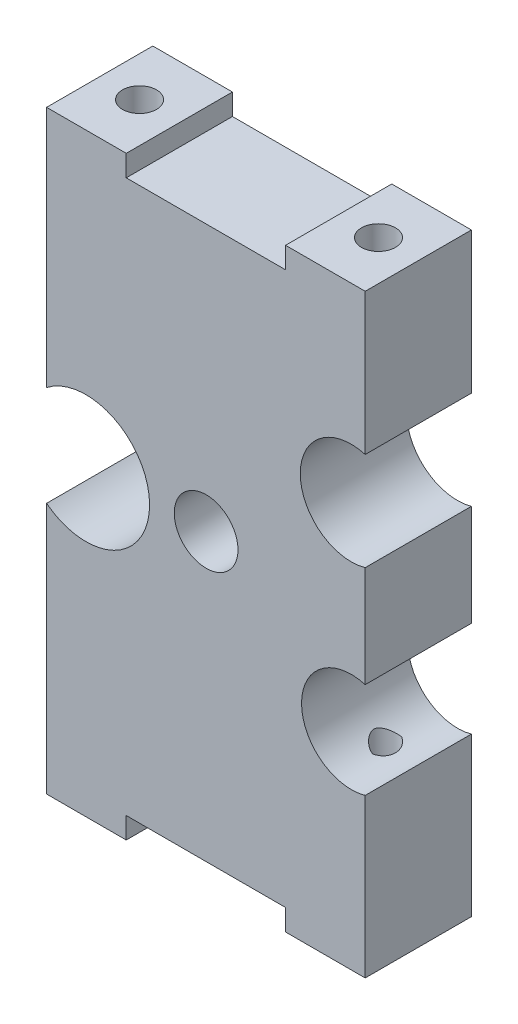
ISO-10303-21;
HEADER;
FILE_DESCRIPTION(('STEP AP214'),'2;1');
FILE_NAME('part.step','',(''),(''),'','','');
FILE_SCHEMA(('AUTOMOTIVE_DESIGN { 1 0 10303 214 1 1 1 1 }'));
ENDSEC;
DATA;
#1=APPLICATION_CONTEXT('core data for automotive mechanical design processes');
#2=APPLICATION_PROTOCOL_DEFINITION('international standard','automotive_design',2000,#1);
#3=PRODUCT_CONTEXT('',#1,'mechanical');
#4=PRODUCT('Part','Part','',(#3));
#5=PRODUCT_RELATED_PRODUCT_CATEGORY('part','',(#4));
#6=PRODUCT_DEFINITION_FORMATION('','',#4);
#7=PRODUCT_DEFINITION_CONTEXT('part definition',#1,'design');
#8=PRODUCT_DEFINITION('design','',#6,#7);
#9=PRODUCT_DEFINITION_SHAPE('','',#8);
#10=(LENGTH_UNIT() NAMED_UNIT(*) SI_UNIT(.MILLI.,.METRE.));
#11=(NAMED_UNIT(*) PLANE_ANGLE_UNIT() SI_UNIT($,.RADIAN.));
#12=(NAMED_UNIT(*) SI_UNIT($,.STERADIAN.) SOLID_ANGLE_UNIT());
#13=UNCERTAINTY_MEASURE_WITH_UNIT(LENGTH_MEASURE(1.E-05),#10,'distance_accuracy_value','');
#14=(GEOMETRIC_REPRESENTATION_CONTEXT(3) GLOBAL_UNCERTAINTY_ASSIGNED_CONTEXT((#13)) GLOBAL_UNIT_ASSIGNED_CONTEXT((#10,
#11,#12)) REPRESENTATION_CONTEXT('',''));
#15=CARTESIAN_POINT('',(0.,0.,0.));
#16=DIRECTION('',(0.,0.,1.));
#17=DIRECTION('',(1.,0.,0.));
#18=AXIS2_PLACEMENT_3D('',#15,#16,#17);
#19=CARTESIAN_POINT('',(-22.3355651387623,-0.533133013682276,20.));
#20=DIRECTION('',(0.,0.,-1.));
#21=DIRECTION('',(-1.,0.,0.));
#22=AXIS2_PLACEMENT_3D('',#19,#20,#21);
#23=PLANE('',#22);
#24=CARTESIAN_POINT('',(-22.3355651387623,-0.533133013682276,20.));
#25=DIRECTION('',(0.,0.,-1.));
#26=DIRECTION('',(-1.,0.,0.));
#27=AXIS2_PLACEMENT_3D('',#24,#25,#26);
#28=CIRCLE('',#27,11.993293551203);
#29=CARTESIAN_POINT('',(-29.7378152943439,8.90327429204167,20.));
#30=VERTEX_POINT('',#29);
#31=CARTESIAN_POINT('',(-29.7378152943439,-9.96954031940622,20.));
#32=VERTEX_POINT('',#31);
#33=EDGE_CURVE('E214',#30,#32,#28,.T.);
#34=ORIENTED_EDGE('',*,*,#33,.T.);
#35=DIRECTION('',(0.,-1.,0.));
#36=VECTOR('',#35,1.);
#37=CARTESIAN_POINT('',(-29.7378152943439,-57.389146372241,20.));
#38=LINE('',#37,#36);
#39=CARTESIAN_POINT('',(-29.7378152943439,-57.389146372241,20.));
#40=VERTEX_POINT('',#39);
#41=EDGE_CURVE('E217',#32,#40,#38,.T.);
#42=ORIENTED_EDGE('',*,*,#41,.T.);
#43=DIRECTION('',(1.,0.,0.));
#44=VECTOR('',#43,1.);
#45=CARTESIAN_POINT('',(-14.7378152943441,-57.389146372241,20.));
#46=LINE('',#45,#44);
#47=CARTESIAN_POINT('',(-14.7378152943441,-57.389146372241,20.));
#48=VERTEX_POINT('',#47);
#49=EDGE_CURVE('E220',#40,#48,#46,.T.);
#50=ORIENTED_EDGE('',*,*,#49,.T.);
#51=DIRECTION('',(0.,1.,0.));
#52=VECTOR('',#51,1.);
#53=CARTESIAN_POINT('',(-14.7378152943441,-53.389146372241,20.));
#54=LINE('',#53,#52);
#55=CARTESIAN_POINT('',(-14.7378152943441,-53.389146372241,20.));
#56=VERTEX_POINT('',#55);
#57=EDGE_CURVE('E222',#48,#56,#54,.T.);
#58=ORIENTED_EDGE('',*,*,#57,.T.);
#59=DIRECTION('',(1.,0.,0.));
#60=VECTOR('',#59,1.);
#61=CARTESIAN_POINT('',(15.2621847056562,-53.389146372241,20.));
#62=LINE('',#61,#60);
#63=CARTESIAN_POINT('',(15.2621847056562,-53.389146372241,20.));
#64=VERTEX_POINT('',#63);
#65=EDGE_CURVE('E224',#56,#64,#62,.T.);
#66=ORIENTED_EDGE('',*,*,#65,.T.);
#67=DIRECTION('',(0.,-1.,0.));
#68=VECTOR('',#67,1.);
#69=CARTESIAN_POINT('',(15.2621847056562,-57.3891463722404,20.));
#70=LINE('',#69,#68);
#71=CARTESIAN_POINT('',(15.2621847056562,-57.3891463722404,20.));
#72=VERTEX_POINT('',#71);
#73=EDGE_CURVE('E226',#64,#72,#70,.T.);
#74=ORIENTED_EDGE('',*,*,#73,.T.);
#75=DIRECTION('',(1.,0.,0.));
#76=VECTOR('',#75,1.);
#77=CARTESIAN_POINT('',(30.2621847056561,-57.3891463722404,20.));
#78=LINE('',#77,#76);
#79=CARTESIAN_POINT('',(30.2621847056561,-57.3891463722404,20.));
#80=VERTEX_POINT('',#79);
#81=EDGE_CURVE('E228',#72,#80,#78,.T.);
#82=ORIENTED_EDGE('',*,*,#81,.T.);
#83=DIRECTION('',(0.,1.,0.));
#84=VECTOR('',#83,1.);
#85=CARTESIAN_POINT('',(30.2621847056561,-27.607184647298,20.));
#86=LINE('',#85,#84);
#87=CARTESIAN_POINT('',(30.2621847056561,-27.607184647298,20.));
#88=VERTEX_POINT('',#87);
#89=EDGE_CURVE('E230',#80,#88,#86,.T.);
#90=ORIENTED_EDGE('',*,*,#89,.T.);
#91=CARTESIAN_POINT('',(27.6706531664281,-18.5753428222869,20.));
#92=DIRECTION('',(0.,0.,-1.));
#93=DIRECTION('',(-1.,0.,0.));
#94=AXIS2_PLACEMENT_3D('',#91,#92,#93);
#95=CIRCLE('',#94,9.39628663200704);
#96=CARTESIAN_POINT('',(30.2621847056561,-9.54350099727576,20.));
#97=VERTEX_POINT('',#96);
#98=EDGE_CURVE('E232',#88,#97,#95,.T.);
#99=ORIENTED_EDGE('',*,*,#98,.T.);
#100=DIRECTION('',(0.,1.,0.));
#101=VECTOR('',#100,1.);
#102=CARTESIAN_POINT('',(30.2621847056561,9.53555622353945,20.));
#103=LINE('',#102,#101);
#104=CARTESIAN_POINT('',(30.2621847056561,9.53555622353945,20.));
#105=VERTEX_POINT('',#104);
#106=EDGE_CURVE('E234',#97,#105,#103,.T.);
#107=ORIENTED_EDGE('',*,*,#106,.T.);
#108=CARTESIAN_POINT('',(27.6334143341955,18.7634673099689,20.));
#109=DIRECTION('',(0.,0.,-1.));
#110=DIRECTION('',(1.,0.,0.));
#111=AXIS2_PLACEMENT_3D('',#108,#109,#110);
#112=CIRCLE('',#111,9.59503917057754);
#113=CARTESIAN_POINT('',(30.2621847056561,27.9913783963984,20.));
#114=VERTEX_POINT('',#113);
#115=EDGE_CURVE('E236',#105,#114,#112,.T.);
#116=ORIENTED_EDGE('',*,*,#115,.T.);
#117=DIRECTION('',(0.,1.,0.));
#118=VECTOR('',#117,1.);
#119=CARTESIAN_POINT('',(30.2621847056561,54.6108536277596,20.));
#120=LINE('',#119,#118);
#121=CARTESIAN_POINT('',(30.2621847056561,54.6108536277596,20.));
#122=VERTEX_POINT('',#121);
#123=EDGE_CURVE('E238',#114,#122,#120,.T.);
#124=ORIENTED_EDGE('',*,*,#123,.T.);
#125=DIRECTION('',(-1.,0.,0.));
#126=VECTOR('',#125,1.);
#127=CARTESIAN_POINT('',(15.2621847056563,54.6108536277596,20.));
#128=LINE('',#127,#126);
#129=CARTESIAN_POINT('',(15.2621847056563,54.6108536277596,20.));
#130=VERTEX_POINT('',#129);
#131=EDGE_CURVE('E240',#122,#130,#128,.T.);
#132=ORIENTED_EDGE('',*,*,#131,.T.);
#133=DIRECTION('',(0.,-1.,0.));
#134=VECTOR('',#133,1.);
#135=CARTESIAN_POINT('',(15.2621847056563,50.610853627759,20.));
#136=LINE('',#135,#134);
#137=CARTESIAN_POINT('',(15.2621847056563,50.610853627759,20.));
#138=VERTEX_POINT('',#137);
#139=EDGE_CURVE('E242',#130,#138,#136,.T.);
#140=ORIENTED_EDGE('',*,*,#139,.T.);
#141=DIRECTION('',(-1.,0.,0.));
#142=VECTOR('',#141,1.);
#143=CARTESIAN_POINT('',(-14.7378152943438,50.610853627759,20.));
#144=LINE('',#143,#142);
#145=CARTESIAN_POINT('',(-14.7378152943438,50.610853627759,20.));
#146=VERTEX_POINT('',#145);
#147=EDGE_CURVE('E244',#138,#146,#144,.T.);
#148=ORIENTED_EDGE('',*,*,#147,.T.);
#149=DIRECTION('',(0.,1.,0.));
#150=VECTOR('',#149,1.);
#151=CARTESIAN_POINT('',(-14.7378152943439,54.610853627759,20.));
#152=LINE('',#151,#150);
#153=CARTESIAN_POINT('',(-14.7378152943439,54.610853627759,20.));
#154=VERTEX_POINT('',#153);
#155=EDGE_CURVE('E246',#146,#154,#152,.T.);
#156=ORIENTED_EDGE('',*,*,#155,.T.);
#157=DIRECTION('',(-1.,0.,0.));
#158=VECTOR('',#157,1.);
#159=CARTESIAN_POINT('',(-29.7378152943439,54.610853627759,20.));
#160=LINE('',#159,#158);
#161=CARTESIAN_POINT('',(-29.7378152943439,54.610853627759,20.));
#162=VERTEX_POINT('',#161);
#163=EDGE_CURVE('E248',#154,#162,#160,.T.);
#164=ORIENTED_EDGE('',*,*,#163,.T.);
#165=DIRECTION('',(0.,-1.,0.));
#166=VECTOR('',#165,1.);
#167=CARTESIAN_POINT('',(-29.7378152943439,8.90327429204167,20.));
#168=LINE('',#167,#166);
#169=EDGE_CURVE('E250',#162,#30,#168,.T.);
#170=ORIENTED_EDGE('',*,*,#169,.T.);
#171=EDGE_LOOP('',(#34,#42,#50,#58,#66,#74,#82,#90,#99,#107,#116,#124,#132,#140,#148,#156,#164,#170));
#172=FACE_BOUND('',#171,.T.);
#173=CARTESIAN_POINT('',(0.301417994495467,0.458443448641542,20.));
#174=DIRECTION('',(0.,0.,1.));
#175=DIRECTION('',(1.,0.,0.));
#176=AXIS2_PLACEMENT_3D('',#173,#174,#175);
#177=CIRCLE('',#176,6.);
#178=CARTESIAN_POINT('',(6.30141799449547,0.458443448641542,20.));
#179=VERTEX_POINT('',#178);
#180=EDGE_CURVE('E208',#179,#179,#177,.T.);
#181=ORIENTED_EDGE('',*,*,#180,.F.);
#182=EDGE_LOOP('',(#181));
#183=FACE_BOUND('',#182,.T.);
#184=ADVANCED_FACE('F32',(#172,#183),#23,.F.);
#185=CARTESIAN_POINT('',(-22.3355651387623,-0.533133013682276,0.));
#186=DIRECTION('',(0.,0.,-1.));
#187=DIRECTION('',(-1.,0.,0.));
#188=AXIS2_PLACEMENT_3D('',#185,#186,#187);
#189=PLANE('',#188);
#190=CARTESIAN_POINT('',(-22.3355651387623,-0.533133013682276,0.));
#191=DIRECTION('',(0.,0.,-1.));
#192=DIRECTION('',(-1.,0.,0.));
#193=AXIS2_PLACEMENT_3D('',#190,#191,#192);
#194=CIRCLE('',#193,11.993293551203);
#195=CARTESIAN_POINT('',(-29.7378152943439,8.90327429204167,0.));
#196=VERTEX_POINT('',#195);
#197=CARTESIAN_POINT('',(-29.7378152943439,-9.96954031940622,0.));
#198=VERTEX_POINT('',#197);
#199=EDGE_CURVE('E211',#196,#198,#194,.T.);
#200=ORIENTED_EDGE('',*,*,#199,.F.);
#201=DIRECTION('',(0.,-1.,0.));
#202=VECTOR('',#201,1.);
#203=CARTESIAN_POINT('',(-29.7378152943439,8.90327429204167,0.));
#204=LINE('',#203,#202);
#205=CARTESIAN_POINT('',(-29.7378152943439,54.610853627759,0.));
#206=VERTEX_POINT('',#205);
#207=EDGE_CURVE('E218',#206,#196,#204,.T.);
#208=ORIENTED_EDGE('',*,*,#207,.F.);
#209=DIRECTION('',(-1.,0.,0.));
#210=VECTOR('',#209,1.);
#211=CARTESIAN_POINT('',(-29.7378152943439,54.610853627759,0.));
#212=LINE('',#211,#210);
#213=CARTESIAN_POINT('',(-14.7378152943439,54.610853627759,0.));
#214=VERTEX_POINT('',#213);
#215=EDGE_CURVE('E285',#214,#206,#212,.T.);
#216=ORIENTED_EDGE('',*,*,#215,.F.);
#217=DIRECTION('',(0.,1.,0.));
#218=VECTOR('',#217,1.);
#219=CARTESIAN_POINT('',(-14.7378152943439,54.610853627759,0.));
#220=LINE('',#219,#218);
#221=CARTESIAN_POINT('',(-14.7378152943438,50.610853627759,0.));
#222=VERTEX_POINT('',#221);
#223=EDGE_CURVE('E283',#222,#214,#220,.T.);
#224=ORIENTED_EDGE('',*,*,#223,.F.);
#225=DIRECTION('',(-1.,0.,0.));
#226=VECTOR('',#225,1.);
#227=CARTESIAN_POINT('',(-14.7378152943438,50.610853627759,0.));
#228=LINE('',#227,#226);
#229=CARTESIAN_POINT('',(15.2621847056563,50.610853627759,0.));
#230=VERTEX_POINT('',#229);
#231=EDGE_CURVE('E281',#230,#222,#228,.T.);
#232=ORIENTED_EDGE('',*,*,#231,.F.);
#233=DIRECTION('',(0.,-1.,0.));
#234=VECTOR('',#233,1.);
#235=CARTESIAN_POINT('',(15.2621847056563,50.610853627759,0.));
#236=LINE('',#235,#234);
#237=CARTESIAN_POINT('',(15.2621847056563,54.6108536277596,0.));
#238=VERTEX_POINT('',#237);
#239=EDGE_CURVE('E279',#238,#230,#236,.T.);
#240=ORIENTED_EDGE('',*,*,#239,.F.);
#241=DIRECTION('',(-1.,0.,0.));
#242=VECTOR('',#241,1.);
#243=CARTESIAN_POINT('',(15.2621847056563,54.6108536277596,0.));
#244=LINE('',#243,#242);
#245=CARTESIAN_POINT('',(30.2621847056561,54.6108536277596,0.));
#246=VERTEX_POINT('',#245);
#247=EDGE_CURVE('E277',#246,#238,#244,.T.);
#248=ORIENTED_EDGE('',*,*,#247,.F.);
#249=DIRECTION('',(0.,1.,0.));
#250=VECTOR('',#249,1.);
#251=CARTESIAN_POINT('',(30.2621847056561,54.6108536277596,0.));
#252=LINE('',#251,#250);
#253=CARTESIAN_POINT('',(30.2621847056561,27.9913783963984,0.));
#254=VERTEX_POINT('',#253);
#255=EDGE_CURVE('E275',#254,#246,#252,.T.);
#256=ORIENTED_EDGE('',*,*,#255,.F.);
#257=CARTESIAN_POINT('',(27.6334143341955,18.7634673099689,0.));
#258=DIRECTION('',(0.,0.,-1.));
#259=DIRECTION('',(1.,0.,0.));
#260=AXIS2_PLACEMENT_3D('',#257,#258,#259);
#261=CIRCLE('',#260,9.59503917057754);
#262=CARTESIAN_POINT('',(30.2621847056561,9.53555622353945,0.));
#263=VERTEX_POINT('',#262);
#264=EDGE_CURVE('E273',#263,#254,#261,.T.);
#265=ORIENTED_EDGE('',*,*,#264,.F.);
#266=DIRECTION('',(0.,1.,0.));
#267=VECTOR('',#266,1.);
#268=CARTESIAN_POINT('',(30.2621847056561,9.53555622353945,0.));
#269=LINE('',#268,#267);
#270=CARTESIAN_POINT('',(30.2621847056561,-9.54350099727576,0.));
#271=VERTEX_POINT('',#270);
#272=EDGE_CURVE('E271',#271,#263,#269,.T.);
#273=ORIENTED_EDGE('',*,*,#272,.F.);
#274=CARTESIAN_POINT('',(27.6706531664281,-18.5753428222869,0.));
#275=DIRECTION('',(0.,0.,-1.));
#276=DIRECTION('',(-1.,0.,0.));
#277=AXIS2_PLACEMENT_3D('',#274,#275,#276);
#278=CIRCLE('',#277,9.39628663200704);
#279=CARTESIAN_POINT('',(30.2621847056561,-27.607184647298,0.));
#280=VERTEX_POINT('',#279);
#281=EDGE_CURVE('E269',#280,#271,#278,.T.);
#282=ORIENTED_EDGE('',*,*,#281,.F.);
#283=DIRECTION('',(0.,1.,0.));
#284=VECTOR('',#283,1.);
#285=CARTESIAN_POINT('',(30.2621847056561,-27.607184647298,0.));
#286=LINE('',#285,#284);
#287=CARTESIAN_POINT('',(30.2621847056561,-57.3891463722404,0.));
#288=VERTEX_POINT('',#287);
#289=EDGE_CURVE('E267',#288,#280,#286,.T.);
#290=ORIENTED_EDGE('',*,*,#289,.F.);
#291=DIRECTION('',(1.,0.,0.));
#292=VECTOR('',#291,1.);
#293=CARTESIAN_POINT('',(30.2621847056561,-57.3891463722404,0.));
#294=LINE('',#293,#292);
#295=CARTESIAN_POINT('',(15.2621847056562,-57.3891463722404,0.));
#296=VERTEX_POINT('',#295);
#297=EDGE_CURVE('E265',#296,#288,#294,.T.);
#298=ORIENTED_EDGE('',*,*,#297,.F.);
#299=DIRECTION('',(0.,-1.,0.));
#300=VECTOR('',#299,1.);
#301=CARTESIAN_POINT('',(15.2621847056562,-57.3891463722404,0.));
#302=LINE('',#301,#300);
#303=CARTESIAN_POINT('',(15.2621847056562,-53.389146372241,0.));
#304=VERTEX_POINT('',#303);
#305=EDGE_CURVE('E263',#304,#296,#302,.T.);
#306=ORIENTED_EDGE('',*,*,#305,.F.);
#307=DIRECTION('',(1.,0.,0.));
#308=VECTOR('',#307,1.);
#309=CARTESIAN_POINT('',(15.2621847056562,-53.389146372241,0.));
#310=LINE('',#309,#308);
#311=CARTESIAN_POINT('',(-14.7378152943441,-53.389146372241,0.));
#312=VERTEX_POINT('',#311);
#313=EDGE_CURVE('E261',#312,#304,#310,.T.);
#314=ORIENTED_EDGE('',*,*,#313,.F.);
#315=DIRECTION('',(0.,1.,0.));
#316=VECTOR('',#315,1.);
#317=CARTESIAN_POINT('',(-14.7378152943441,-53.389146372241,0.));
#318=LINE('',#317,#316);
#319=CARTESIAN_POINT('',(-14.7378152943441,-57.389146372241,0.));
#320=VERTEX_POINT('',#319);
#321=EDGE_CURVE('E259',#320,#312,#318,.T.);
#322=ORIENTED_EDGE('',*,*,#321,.F.);
#323=DIRECTION('',(1.,0.,0.));
#324=VECTOR('',#323,1.);
#325=CARTESIAN_POINT('',(-14.7378152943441,-57.389146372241,0.));
#326=LINE('',#325,#324);
#327=CARTESIAN_POINT('',(-29.7378152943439,-57.389146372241,0.));
#328=VERTEX_POINT('',#327);
#329=EDGE_CURVE('E257',#328,#320,#326,.T.);
#330=ORIENTED_EDGE('',*,*,#329,.F.);
#331=DIRECTION('',(0.,-1.,0.));
#332=VECTOR('',#331,1.);
#333=CARTESIAN_POINT('',(-29.7378152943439,-57.389146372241,0.));
#334=LINE('',#333,#332);
#335=EDGE_CURVE('E255',#198,#328,#334,.T.);
#336=ORIENTED_EDGE('',*,*,#335,.F.);
#337=EDGE_LOOP('',(#200,#208,#216,#224,#232,#240,#248,#256,#265,#273,#282,#290,#298,#306,#314,
#322,#330,#336));
#338=FACE_BOUND('',#337,.T.);
#339=CARTESIAN_POINT('',(0.301417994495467,0.458443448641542,0.));
#340=DIRECTION('',(0.,0.,1.));
#341=DIRECTION('',(1.,0.,0.));
#342=AXIS2_PLACEMENT_3D('',#339,#340,#341);
#343=CIRCLE('',#342,6.);
#344=CARTESIAN_POINT('',(6.30141799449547,0.458443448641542,0.));
#345=VERTEX_POINT('',#344);
#346=EDGE_CURVE('E207',#345,#345,#343,.T.);
#347=ORIENTED_EDGE('',*,*,#346,.T.);
#348=EDGE_LOOP('',(#347));
#349=FACE_BOUND('',#348,.T.);
#350=ADVANCED_FACE('F381',(#338,#349),#189,.T.);
#351=CARTESIAN_POINT('',(-22.3355651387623,-0.533133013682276,20.));
#352=DIRECTION('',(0.,0.,-1.));
#353=DIRECTION('',(-1.,0.,0.));
#354=AXIS2_PLACEMENT_3D('',#351,#352,#353);
#355=CYLINDRICAL_SURFACE('',#354,11.993293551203);
#356=ORIENTED_EDGE('',*,*,#199,.T.);
#357=DIRECTION('',(0.,0.,-1.));
#358=VECTOR('',#357,1.);
#359=CARTESIAN_POINT('',(-29.7378152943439,-9.96954031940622,20.));
#360=LINE('',#359,#358);
#361=EDGE_CURVE('E338',#32,#198,#360,.T.);
#362=ORIENTED_EDGE('',*,*,#361,.F.);
#363=ORIENTED_EDGE('',*,*,#33,.F.);
#364=DIRECTION('',(0.,0.,-1.));
#365=VECTOR('',#364,1.);
#366=CARTESIAN_POINT('',(-29.7378152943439,8.90327429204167,20.));
#367=LINE('',#366,#365);
#368=EDGE_CURVE('E252',#30,#196,#367,.T.);
#369=ORIENTED_EDGE('',*,*,#368,.T.);
#370=EDGE_LOOP('',(#356,#362,#363,#369));
#371=FACE_BOUND('',#370,.T.);
#372=ADVANCED_FACE('F34',(#371),#355,.F.);
#373=CARTESIAN_POINT('',(-29.7378152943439,-57.389146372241,20.));
#374=DIRECTION('',(1.,0.,0.));
#375=DIRECTION('',(0.,0.,-1.));
#376=AXIS2_PLACEMENT_3D('',#373,#374,#375);
#377=PLANE('',#376);
#378=ORIENTED_EDGE('',*,*,#335,.T.);
#379=DIRECTION('',(0.,0.,-1.));
#380=VECTOR('',#379,1.);
#381=CARTESIAN_POINT('',(-29.7378152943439,-57.389146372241,20.));
#382=LINE('',#381,#380);
#383=EDGE_CURVE('E335',#40,#328,#382,.T.);
#384=ORIENTED_EDGE('',*,*,#383,.F.);
#385=ORIENTED_EDGE('',*,*,#41,.F.);
#386=ORIENTED_EDGE('',*,*,#361,.T.);
#387=EDGE_LOOP('',(#378,#384,#385,#386));
#388=FACE_BOUND('',#387,.T.);
#389=ADVANCED_FACE('F506',(#388),#377,.F.);
#390=CARTESIAN_POINT('',(-14.7378152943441,-57.389146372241,20.));
#391=DIRECTION('',(0.,1.,0.));
#392=DIRECTION('',(0.,0.,1.));
#393=AXIS2_PLACEMENT_3D('',#390,#391,#392);
#394=PLANE('',#393);
#395=CARTESIAN_POINT('',(-22.2378152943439,-57.389146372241,10.));
#396=DIRECTION('',(0.,-1.,0.));
#397=DIRECTION('',(0.,0.,-1.));
#398=AXIS2_PLACEMENT_3D('',#395,#396,#397);
#399=CIRCLE('',#398,3.19999999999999);
#400=CARTESIAN_POINT('',(-22.2378152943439,-57.389146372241,6.80000000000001));
#401=VERTEX_POINT('',#400);
#402=EDGE_CURVE('E201',#401,#401,#399,.T.);
#403=ORIENTED_EDGE('',*,*,#402,.F.);
#404=EDGE_LOOP('',(#403));
#405=FACE_BOUND('',#404,.T.);
#406=ORIENTED_EDGE('',*,*,#329,.T.);
#407=DIRECTION('',(0.,0.,-1.));
#408=VECTOR('',#407,1.);
#409=CARTESIAN_POINT('',(-14.7378152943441,-57.389146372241,20.));
#410=LINE('',#409,#408);
#411=EDGE_CURVE('E332',#48,#320,#410,.T.);
#412=ORIENTED_EDGE('',*,*,#411,.F.);
#413=ORIENTED_EDGE('',*,*,#49,.F.);
#414=ORIENTED_EDGE('',*,*,#383,.T.);
#415=EDGE_LOOP('',(#406,#412,#413,#414));
#416=FACE_BOUND('',#415,.T.);
#417=ADVANCED_FACE('F503',(#405,#416),#394,.F.);
#418=CARTESIAN_POINT('',(-14.7378152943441,-53.389146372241,20.));
#419=DIRECTION('',(-1.,0.,0.));
#420=DIRECTION('',(0.,-1.,0.));
#421=AXIS2_PLACEMENT_3D('',#418,#419,#420);
#422=PLANE('',#421);
#423=ORIENTED_EDGE('',*,*,#321,.T.);
#424=DIRECTION('',(0.,0.,-1.));
#425=VECTOR('',#424,1.);
#426=CARTESIAN_POINT('',(-14.7378152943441,-53.389146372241,20.));
#427=LINE('',#426,#425);
#428=EDGE_CURVE('E329',#56,#312,#427,.T.);
#429=ORIENTED_EDGE('',*,*,#428,.F.);
#430=ORIENTED_EDGE('',*,*,#57,.F.);
#431=ORIENTED_EDGE('',*,*,#411,.T.);
#432=EDGE_LOOP('',(#423,#429,#430,#431));
#433=FACE_BOUND('',#432,.T.);
#434=ADVANCED_FACE('F500',(#433),#422,.F.);
#435=CARTESIAN_POINT('',(15.2621847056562,-53.389146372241,20.));
#436=DIRECTION('',(0.,1.,0.));
#437=DIRECTION('',(0.,0.,1.));
#438=AXIS2_PLACEMENT_3D('',#435,#436,#437);
#439=PLANE('',#438);
#440=ORIENTED_EDGE('',*,*,#313,.T.);
#441=DIRECTION('',(0.,0.,-1.));
#442=VECTOR('',#441,1.);
#443=CARTESIAN_POINT('',(15.2621847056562,-53.389146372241,20.));
#444=LINE('',#443,#442);
#445=EDGE_CURVE('E326',#64,#304,#444,.T.);
#446=ORIENTED_EDGE('',*,*,#445,.F.);
#447=ORIENTED_EDGE('',*,*,#65,.F.);
#448=ORIENTED_EDGE('',*,*,#428,.T.);
#449=EDGE_LOOP('',(#440,#446,#447,#448));
#450=FACE_BOUND('',#449,.T.);
#451=ADVANCED_FACE('F496',(#450),#439,.F.);
#452=CARTESIAN_POINT('',(15.2621847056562,-57.3891463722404,20.));
#453=DIRECTION('',(1.,0.,0.));
#454=DIRECTION('',(0.,0.,-1.));
#455=AXIS2_PLACEMENT_3D('',#452,#453,#454);
#456=PLANE('',#455);
#457=ORIENTED_EDGE('',*,*,#305,.T.);
#458=DIRECTION('',(0.,0.,-1.));
#459=VECTOR('',#458,1.);
#460=CARTESIAN_POINT('',(15.2621847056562,-57.3891463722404,20.));
#461=LINE('',#460,#459);
#462=EDGE_CURVE('E323',#72,#296,#461,.T.);
#463=ORIENTED_EDGE('',*,*,#462,.F.);
#464=ORIENTED_EDGE('',*,*,#73,.F.);
#465=ORIENTED_EDGE('',*,*,#445,.T.);
#466=EDGE_LOOP('',(#457,#463,#464,#465));
#467=FACE_BOUND('',#466,.T.);
#468=ADVANCED_FACE('F491',(#467),#456,.F.);
#469=CARTESIAN_POINT('',(30.2621847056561,-57.3891463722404,20.));
#470=DIRECTION('',(0.,1.,0.));
#471=DIRECTION('',(0.,0.,1.));
#472=AXIS2_PLACEMENT_3D('',#469,#470,#471);
#473=PLANE('',#472);
#474=CARTESIAN_POINT('',(22.7621847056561,-57.3891463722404,10.));
#475=DIRECTION('',(0.,-1.,0.));
#476=DIRECTION('',(0.,0.,-1.));
#477=AXIS2_PLACEMENT_3D('',#474,#475,#476);
#478=CIRCLE('',#477,3.19999999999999);
#479=CARTESIAN_POINT('',(22.7621847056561,-57.3891463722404,6.80000000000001));
#480=VERTEX_POINT('',#479);
#481=EDGE_CURVE('E197',#480,#480,#478,.T.);
#482=ORIENTED_EDGE('',*,*,#481,.F.);
#483=EDGE_LOOP('',(#482));
#484=FACE_BOUND('',#483,.T.);
#485=ORIENTED_EDGE('',*,*,#297,.T.);
#486=DIRECTION('',(0.,0.,-1.));
#487=VECTOR('',#486,1.);
#488=CARTESIAN_POINT('',(30.2621847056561,-57.3891463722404,20.));
#489=LINE('',#488,#487);
#490=EDGE_CURVE('E320',#80,#288,#489,.T.);
#491=ORIENTED_EDGE('',*,*,#490,.F.);
#492=ORIENTED_EDGE('',*,*,#81,.F.);
#493=ORIENTED_EDGE('',*,*,#462,.T.);
#494=EDGE_LOOP('',(#485,#491,#492,#493));
#495=FACE_BOUND('',#494,.T.);
#496=ADVANCED_FACE('F485',(#484,#495),#473,.F.);
#497=CARTESIAN_POINT('',(30.2621847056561,-27.607184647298,20.));
#498=DIRECTION('',(-1.,0.,0.));
#499=DIRECTION('',(0.,0.,1.));
#500=AXIS2_PLACEMENT_3D('',#497,#498,#499);
#501=PLANE('',#500);
#502=ORIENTED_EDGE('',*,*,#289,.T.);
#503=DIRECTION('',(0.,0.,-1.));
#504=VECTOR('',#503,1.);
#505=CARTESIAN_POINT('',(30.2621847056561,-27.607184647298,20.));
#506=LINE('',#505,#504);
#507=EDGE_CURVE('E317',#88,#280,#506,.T.);
#508=ORIENTED_EDGE('',*,*,#507,.F.);
#509=ORIENTED_EDGE('',*,*,#89,.F.);
#510=ORIENTED_EDGE('',*,*,#490,.T.);
#511=EDGE_LOOP('',(#502,#508,#509,#510));
#512=FACE_BOUND('',#511,.T.);
#513=ADVANCED_FACE('F481',(#512),#501,.F.);
#514=CARTESIAN_POINT('',(27.6706531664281,-18.5753428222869,20.));
#515=DIRECTION('',(0.,0.,-1.));
#516=DIRECTION('',(-1.,0.,0.));
#517=AXIS2_PLACEMENT_3D('',#514,#515,#516);
#518=CYLINDRICAL_SURFACE('',#517,9.39628663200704);
#519=CARTESIAN_POINT('',(24.9916343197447,-27.5816217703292,12.7243894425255));
#520=CARTESIAN_POINT('',(24.9309583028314,-27.5635787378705,12.7352410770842));
#521=CARTESIAN_POINT('',(24.8700214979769,-27.544778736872,12.7430827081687));
#522=CARTESIAN_POINT('',(24.7482014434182,-27.5058266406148,12.7529861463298));
#523=CARTESIAN_POINT('',(24.6873182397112,-27.485676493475,12.7550561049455));
#524=CARTESIAN_POINT('',(24.5067175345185,-27.4238312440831,12.7530158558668));
#525=CARTESIAN_POINT('',(24.3876613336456,-27.3803288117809,12.7408870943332));
#526=CARTESIAN_POINT('',(24.1243477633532,-27.2781427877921,12.692512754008));
#527=CARTESIAN_POINT('',(23.9815276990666,-27.218441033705,12.6508453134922));
#528=CARTESIAN_POINT('',(23.7058475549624,-27.0955237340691,12.544066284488));
#529=CARTESIAN_POINT('',(23.5730444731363,-27.032291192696,12.4788312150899));
#530=CARTESIAN_POINT('',(23.3587909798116,-26.924451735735,12.3531713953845));
#531=CARTESIAN_POINT('',(23.2742426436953,-26.8801866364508,12.2975921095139));
#532=CARTESIAN_POINT('',(23.1107021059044,-26.7915279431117,12.178780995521));
#533=CARTESIAN_POINT('',(23.0317125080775,-26.7471342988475,12.1155456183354));
#534=CARTESIAN_POINT('',(22.8794408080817,-26.6587973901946,11.9822485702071));
#535=CARTESIAN_POINT('',(22.806159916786,-26.6148542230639,11.9121854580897));
#536=CARTESIAN_POINT('',(22.6655492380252,-26.5280752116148,11.7657359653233));
#537=CARTESIAN_POINT('',(22.5982170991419,-26.4852389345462,11.6893521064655));
#538=CARTESIAN_POINT('',(22.4878859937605,-26.4132107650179,11.5526419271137));
#539=CARTESIAN_POINT('',(22.4433474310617,-26.3835528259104,11.4937976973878));
#540=CARTESIAN_POINT('',(22.3578915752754,-26.3256607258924,11.3728764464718));
#541=CARTESIAN_POINT('',(22.316973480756,-26.2974262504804,11.3108001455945));
#542=CARTESIAN_POINT('',(22.2392719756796,-26.2429725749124,11.1834208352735));
#543=CARTESIAN_POINT('',(22.2024810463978,-26.2167497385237,11.118124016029));
#544=CARTESIAN_POINT('',(22.1336378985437,-26.1670137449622,10.9841329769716));
#545=CARTESIAN_POINT('',(22.101583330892,-26.1434992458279,10.9154404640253));
#546=CARTESIAN_POINT('',(22.0346172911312,-26.0938204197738,10.7540150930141));
#547=CARTESIAN_POINT('',(22.0015720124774,-26.0688644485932,10.6600864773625));
#548=CARTESIAN_POINT('',(21.9611151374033,-26.0380278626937,10.5153527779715));
#549=CARTESIAN_POINT('',(21.9491521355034,-26.0288518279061,10.4664962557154));
#550=CARTESIAN_POINT('',(21.9286063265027,-26.0130352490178,10.367684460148));
#551=CARTESIAN_POINT('',(21.9200216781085,-26.0063933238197,10.317729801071));
#552=CARTESIAN_POINT('',(21.9064617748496,-25.995880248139,10.2164313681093));
#553=CARTESIAN_POINT('',(21.9015302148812,-25.9920426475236,10.1650781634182));
#554=CARTESIAN_POINT('',(21.8956560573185,-25.9874697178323,10.0620054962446));
#555=CARTESIAN_POINT('',(21.8947131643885,-25.9867341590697,10.0102860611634));
#556=CARTESIAN_POINT('',(21.896859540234,-25.9884063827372,9.90696704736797));
#557=CARTESIAN_POINT('',(21.8999500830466,-25.990815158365,9.85536751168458));
#558=CARTESIAN_POINT('',(21.9100266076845,-25.9986455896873,9.75278292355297));
#559=CARTESIAN_POINT('',(21.9170131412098,-26.0040676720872,9.70179795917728));
#560=CARTESIAN_POINT('',(21.9355697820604,-26.0184048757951,9.59527546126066));
#561=CARTESIAN_POINT('',(21.9475598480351,-26.0276388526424,9.53985472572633));
#562=CARTESIAN_POINT('',(21.975509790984,-26.0490201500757,9.43057583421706));
#563=CARTESIAN_POINT('',(21.9914725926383,-26.0611696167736,9.37671886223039));
#564=CARTESIAN_POINT('',(22.0269007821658,-26.0879159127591,9.27064584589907));
#565=CARTESIAN_POINT('',(22.0463751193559,-26.1025189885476,9.21843440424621));
#566=CARTESIAN_POINT('',(22.0883341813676,-26.1336892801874,9.11587117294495));
#567=CARTESIAN_POINT('',(22.1108182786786,-26.1502560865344,9.06551899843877));
#568=CARTESIAN_POINT('',(22.1737368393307,-26.1961334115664,8.93481732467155));
#569=CARTESIAN_POINT('',(22.2164124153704,-26.2267847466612,8.85601327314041));
#570=CARTESIAN_POINT('',(22.3076381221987,-26.2910016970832,8.70312553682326));
#571=CARTESIAN_POINT('',(22.356192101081,-26.3245692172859,8.62904499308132));
#572=CARTESIAN_POINT('',(22.4584698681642,-26.3937292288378,8.48535545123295));
#573=CARTESIAN_POINT('',(22.5122017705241,-26.429324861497,8.41575376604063));
#574=CARTESIAN_POINT('',(22.624284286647,-26.5018060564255,8.2811363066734));
#575=CARTESIAN_POINT('',(22.6826338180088,-26.5386913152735,8.21611946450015));
#576=CARTESIAN_POINT('',(22.8076749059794,-26.6157025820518,8.08665678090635));
#577=CARTESIAN_POINT('',(22.8746626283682,-26.655882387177,8.0225285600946));
#578=CARTESIAN_POINT('',(23.0134420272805,-26.7366562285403,7.89994493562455));
#579=CARTESIAN_POINT('',(23.0852346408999,-26.7772503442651,7.84149064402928));
#580=CARTESIAN_POINT('',(23.2334170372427,-26.8583530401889,7.7309447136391));
#581=CARTESIAN_POINT('',(23.3097992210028,-26.8988616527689,7.67884296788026));
#582=CARTESIAN_POINT('',(23.4671679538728,-26.9794330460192,7.58173825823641));
#583=CARTESIAN_POINT('',(23.548154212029,-27.0194958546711,7.53673484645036));
#584=CARTESIAN_POINT('',(23.749580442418,-27.1153956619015,7.43769911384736));
#585=CARTESIAN_POINT('',(23.8723192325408,-27.1707996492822,7.38779891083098));
#586=CARTESIAN_POINT('',(24.125322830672,-27.2781924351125,7.30859279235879));
#587=CARTESIAN_POINT('',(24.2555579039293,-27.3301931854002,7.27921086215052));
#588=CARTESIAN_POINT('',(24.4870607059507,-27.416499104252,7.24966403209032));
#589=CARTESIAN_POINT('',(24.5871804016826,-27.4519196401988,7.24393444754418));
#590=CARTESIAN_POINT('',(24.7383239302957,-27.5025208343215,7.24684894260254));
#591=CARTESIAN_POINT('',(24.7890491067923,-27.5190207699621,7.24976994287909));
#592=CARTESIAN_POINT('',(24.8904570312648,-27.5510629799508,7.25963572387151));
#593=CARTESIAN_POINT('',(24.9411397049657,-27.5666044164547,7.26658397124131));
#594=CARTESIAN_POINT('',(24.9916343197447,-27.5816217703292,7.27561055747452));
#595=B_SPLINE_CURVE_WITH_KNOTS('',3,(#519,#520,#521,#522,#523,#524,#525,#526,#527,#528,#529,
#530,#531,#532,#533,#534,#535,#536,#537,#538,#539,#540,#541,#542,#543,#544,#545,#546,#547,#548,
#549,#550,#551,#552,#553,#554,#555,#556,#557,#558,#559,#560,#561,#562,#563,#564,#565,#566,#567,
#568,#569,#570,#571,#572,#573,#574,#575,#576,#577,#578,#579,#580,#581,#582,#583,#584,#585,#586,
#587,#588,#589,#590,#591,#592,#593,#594),.UNSPECIFIED.,.F.,.F.,(4,2,2,2,2,2,2,2,2,2,2,2,2,2,2,2,
2,2,2,2,2,2,2,2,2,2,2,2,2,2,2,2,2,2,2,2,2,4),(0.,0.192517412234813,0.384762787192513,
0.764920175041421,1.24330853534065,1.72424061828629,2.0551749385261,2.38626325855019,
2.71742161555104,3.0484484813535,3.2869154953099,3.52532958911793,3.76330204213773,
4.00115606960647,4.30797123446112,4.46120884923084,4.6143628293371,4.76932035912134,
4.92426641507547,5.07926142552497,5.23427838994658,5.40636262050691,5.57857391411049,
5.75123046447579,5.9238510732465,6.20754451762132,6.49142468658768,6.77575718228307,
7.0600232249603,7.36294873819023,7.66593350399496,7.96842974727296,8.2709068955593,
8.70027356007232,9.12804097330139,9.44597651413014,9.60609484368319,9.7663512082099),.UNSPECIFIED.);
#596=CARTESIAN_POINT('',(24.4138035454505,-27.3891463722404,12.7408311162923));
#597=VERTEX_POINT('',#596);
#598=CARTESIAN_POINT('',(24.4138035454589,-27.3891463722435,7.25916888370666));
#599=VERTEX_POINT('',#598);
#600=EDGE_CURVE('E341',#597,#599,#595,.T.);
#601=ORIENTED_EDGE('',*,*,#600,.T.);
#602=CARTESIAN_POINT('',(24.4138035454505,-27.3891463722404,7.25916888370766));
#603=CARTESIAN_POINT('',(24.4856330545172,-27.4156954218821,7.30243697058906));
#604=CARTESIAN_POINT('',(24.5561542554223,-27.4407493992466,7.34879743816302));
#605=CARTESIAN_POINT('',(24.69394127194,-27.4879552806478,7.44745728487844));
#606=CARTESIAN_POINT('',(24.7612069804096,-27.5101070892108,7.49975685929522));
#607=CARTESIAN_POINT('',(24.8917737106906,-27.5515740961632,7.60999070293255));
#608=CARTESIAN_POINT('',(24.9550786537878,-27.5708921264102,7.66791924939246));
#609=CARTESIAN_POINT('',(25.0771813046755,-27.6068519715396,7.78907262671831));
#610=CARTESIAN_POINT('',(25.1359792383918,-27.6234939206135,7.85229719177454));
#611=CARTESIAN_POINT('',(25.3048858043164,-27.6696802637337,8.04947339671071));
#612=CARTESIAN_POINT('',(25.4074905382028,-27.6954800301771,8.19091353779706));
#613=CARTESIAN_POINT('',(25.5886308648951,-27.738536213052,8.4894584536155));
#614=CARTESIAN_POINT('',(25.6671722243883,-27.755794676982,8.64655946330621));
#615=CARTESIAN_POINT('',(25.7973365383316,-27.7832364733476,8.97126814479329));
#616=CARTESIAN_POINT('',(25.8490845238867,-27.7934527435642,9.13882285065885));
#617=CARTESIAN_POINT('',(25.9245629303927,-27.8080491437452,9.48040781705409));
#618=CARTESIAN_POINT('',(25.9482860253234,-27.8124277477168,9.654439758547));
#619=CARTESIAN_POINT('',(25.9670435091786,-27.815906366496,10.0055150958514));
#620=CARTESIAN_POINT('',(25.9618436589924,-27.8149632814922,10.1825714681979));
#621=CARTESIAN_POINT('',(25.9223646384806,-27.8075734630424,10.5332842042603));
#622=CARTESIAN_POINT('',(25.8880883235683,-27.8011272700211,10.7069409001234));
#623=CARTESIAN_POINT('',(25.7914807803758,-27.7819345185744,11.0462039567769));
#624=CARTESIAN_POINT('',(25.7291020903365,-27.7691772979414,11.211796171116));
#625=CARTESIAN_POINT('',(25.5782400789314,-27.7360157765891,11.5299598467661));
#626=CARTESIAN_POINT('',(25.4897520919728,-27.7156101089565,11.6825289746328));
#627=CARTESIAN_POINT('',(25.3402620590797,-27.6782043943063,11.8976643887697));
#628=CARTESIAN_POINT('',(25.2877944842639,-27.6646462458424,11.9669299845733));
#629=CARTESIAN_POINT('',(25.1777008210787,-27.635069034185,12.1006583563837));
#630=CARTESIAN_POINT('',(25.1200767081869,-27.6190509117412,12.165122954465));
#631=CARTESIAN_POINT('',(25.0002626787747,-27.5843994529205,12.2887584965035));
#632=CARTESIAN_POINT('',(24.9380773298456,-27.5657687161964,12.3479346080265));
#633=CARTESIAN_POINT('',(24.8096965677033,-27.5257420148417,12.4606883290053));
#634=CARTESIAN_POINT('',(24.7435030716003,-27.5043473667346,12.5142685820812));
#635=CARTESIAN_POINT('',(24.6331672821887,-27.4672430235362,12.5965807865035));
#636=CARTESIAN_POINT('',(24.5900532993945,-27.4524059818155,12.627102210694));
#637=CARTESIAN_POINT('',(24.5027291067,-27.4216190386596,12.6857528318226));
#638=CARTESIAN_POINT('',(24.458520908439,-27.4056710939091,12.7138860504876));
#639=CARTESIAN_POINT('',(24.4138035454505,-27.3891463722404,12.7408311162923));
#640=B_SPLINE_CURVE_WITH_KNOTS('',3,(#602,#603,#604,#605,#606,#607,#608,#609,#610,#611,#612,
#613,#614,#615,#616,#617,#618,#619,#620,#621,#622,#623,#624,#625,#626,#627,#628,#629,#630,#631,
#632,#633,#634,#635,#636,#637,#638,#639),.UNSPECIFIED.,.F.,.F.,(4,2,2,2,2,2,2,2,2,2,2,2,2,2,2,2,
2,2,4),(0.,0.263796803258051,0.527602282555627,0.79114231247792,1.05466912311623,
1.58178897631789,2.10878240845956,2.6332939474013,3.15794256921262,3.68684633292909,
4.21569816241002,4.7454465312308,5.2752896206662,5.53886597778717,5.80234178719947,
6.06555726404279,6.32864782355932,6.49318391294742,6.65743718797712),.UNSPECIFIED.);
#641=EDGE_CURVE('E349',#599,#597,#640,.T.);
#642=ORIENTED_EDGE('',*,*,#641,.T.);
#643=EDGE_LOOP('',(#601,#642));
#644=FACE_BOUND('',#643,.T.);
#645=ORIENTED_EDGE('',*,*,#281,.T.);
#646=DIRECTION('',(0.,0.,-1.));
#647=VECTOR('',#646,1.);
#648=CARTESIAN_POINT('',(30.2621847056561,-9.54350099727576,20.));
#649=LINE('',#648,#647);
#650=EDGE_CURVE('E314',#97,#271,#649,.T.);
#651=ORIENTED_EDGE('',*,*,#650,.F.);
#652=ORIENTED_EDGE('',*,*,#98,.F.);
#653=ORIENTED_EDGE('',*,*,#507,.T.);
#654=EDGE_LOOP('',(#645,#651,#652,#653));
#655=FACE_BOUND('',#654,.T.);
#656=ADVANCED_FACE('F354',(#644,#655),#518,.F.);
#657=CARTESIAN_POINT('',(30.2621847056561,9.53555622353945,20.));
#658=DIRECTION('',(-1.,0.,0.));
#659=DIRECTION('',(0.,0.,1.));
#660=AXIS2_PLACEMENT_3D('',#657,#658,#659);
#661=PLANE('',#660);
#662=ORIENTED_EDGE('',*,*,#272,.T.);
#663=DIRECTION('',(0.,0.,-1.));
#664=VECTOR('',#663,1.);
#665=CARTESIAN_POINT('',(30.2621847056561,9.53555622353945,20.));
#666=LINE('',#665,#664);
#667=EDGE_CURVE('E311',#105,#263,#666,.T.);
#668=ORIENTED_EDGE('',*,*,#667,.F.);
#669=ORIENTED_EDGE('',*,*,#106,.F.);
#670=ORIENTED_EDGE('',*,*,#650,.T.);
#671=EDGE_LOOP('',(#662,#668,#669,#670));
#672=FACE_BOUND('',#671,.T.);
#673=ADVANCED_FACE('F415',(#672),#661,.F.);
#674=CARTESIAN_POINT('',(27.6334143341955,18.7634673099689,20.));
#675=DIRECTION('',(0.,0.,-1.));
#676=DIRECTION('',(-1.,0.,0.));
#677=AXIS2_PLACEMENT_3D('',#674,#675,#676);
#678=CYLINDRICAL_SURFACE('',#677,9.59503917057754);
#679=CARTESIAN_POINT('',(22.0773052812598,26.5861541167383,3.54880052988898));
#680=CARTESIAN_POINT('',(21.9944076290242,26.5272690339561,3.65616922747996));
#681=CARTESIAN_POINT('',(21.9141222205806,26.4682696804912,3.76546482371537));
#682=CARTESIAN_POINT('',(21.7585378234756,26.350308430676,3.98753218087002));
#683=CARTESIAN_POINT('',(21.6832377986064,26.2913465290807,4.1003032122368));
#684=CARTESIAN_POINT('',(21.5373377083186,26.1736900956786,4.3290108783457));
#685=CARTESIAN_POINT('',(21.4667385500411,26.1149956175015,4.44494811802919));
#686=CARTESIAN_POINT('',(21.3300593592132,25.9981461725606,4.67972304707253));
#687=CARTESIAN_POINT('',(21.2639795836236,25.9399912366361,4.79856090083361));
#688=CARTESIAN_POINT('',(21.0724120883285,25.7668690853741,5.15886784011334));
#689=CARTESIAN_POINT('',(20.9534237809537,25.6531035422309,5.40440287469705));
#690=CARTESIAN_POINT('',(20.7321812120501,25.4314662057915,5.90537040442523));
#691=CARTESIAN_POINT('',(20.6299205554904,25.3235921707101,6.16079907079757));
#692=CARTESIAN_POINT('',(20.5049077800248,25.1861875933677,6.50789030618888));
#693=CARTESIAN_POINT('',(20.4746042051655,25.1523778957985,6.59519069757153));
#694=CARTESIAN_POINT('',(20.4159261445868,25.0860142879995,6.77089837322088));
#695=CARTESIAN_POINT('',(20.3875513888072,25.0534602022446,6.85930550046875));
#696=CARTESIAN_POINT('',(20.3267859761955,24.9828384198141,7.0567094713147));
#697=CARTESIAN_POINT('',(20.2948742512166,24.9451220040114,7.16598068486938));
#698=CARTESIAN_POINT('',(20.2340630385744,24.8722017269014,7.38639929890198));
#699=CARTESIAN_POINT('',(20.2051686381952,24.837002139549,7.49754951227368));
#700=CARTESIAN_POINT('',(20.1331649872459,24.7481207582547,7.79322754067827));
#701=CARTESIAN_POINT('',(20.0927828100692,24.6970157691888,7.97922186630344));
#702=CARTESIAN_POINT('',(20.0216668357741,24.6055087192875,8.35574190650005));
#703=CARTESIAN_POINT('',(19.9909354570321,24.5651093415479,8.54626874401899));
#704=CARTESIAN_POINT('',(19.9403416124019,24.4978542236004,8.9307498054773));
#705=CARTESIAN_POINT('',(19.9204549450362,24.4709683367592,9.12469539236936));
#706=CARTESIAN_POINT('',(19.8924978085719,24.4329969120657,9.51494649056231));
#707=CARTESIAN_POINT('',(19.8844221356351,24.4219044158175,9.71125092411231));
#708=CARTESIAN_POINT('',(19.880654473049,24.4167405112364,10.097071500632));
#709=CARTESIAN_POINT('',(19.8845235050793,24.4220657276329,10.2865753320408));
#710=CARTESIAN_POINT('',(19.9034607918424,24.4479056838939,10.6640103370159));
#711=CARTESIAN_POINT('',(19.9185328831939,24.4684256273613,10.8519409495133));
#712=CARTESIAN_POINT('',(19.9591016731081,24.5228803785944,11.2248918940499));
#713=CARTESIAN_POINT('',(19.9846121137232,24.5568328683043,11.4099080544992));
#714=CARTESIAN_POINT('',(20.0450210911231,24.6357342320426,11.7759136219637));
#715=CARTESIAN_POINT('',(20.079916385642,24.6806793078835,11.9569043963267));
#716=CARTESIAN_POINT('',(20.1283659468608,24.7416988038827,12.1784466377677));
#717=CARTESIAN_POINT('',(20.13795073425,24.7537134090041,12.2210508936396));
#718=CARTESIAN_POINT('',(20.1575774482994,24.7781897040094,12.3059535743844));
#719=CARTESIAN_POINT('',(20.167618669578,24.7906506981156,12.34825236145));
#720=CARTESIAN_POINT('',(20.2242911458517,24.860605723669,12.5809837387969));
#721=CARTESIAN_POINT('',(20.2753834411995,24.9223180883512,12.7690945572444));
#722=CARTESIAN_POINT('',(20.3861964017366,25.0523397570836,13.1405185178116));
#723=CARTESIAN_POINT('',(20.4459230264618,25.1206536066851,13.3238282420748));
#724=CARTESIAN_POINT('',(20.5741126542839,25.2627189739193,13.6872675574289));
#725=CARTESIAN_POINT('',(20.6426476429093,25.3365129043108,13.8673551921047));
#726=CARTESIAN_POINT('',(20.7515097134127,25.4497897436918,14.1337258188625));
#727=CARTESIAN_POINT('',(20.7887822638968,25.4879554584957,14.2218362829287));
#728=CARTESIAN_POINT('',(20.865364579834,25.5650281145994,14.3968331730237));
#729=CARTESIAN_POINT('',(20.9046742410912,25.6039350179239,14.4837196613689));
#730=CARTESIAN_POINT('',(20.9450081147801,25.643147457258,14.5699938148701));
#731=B_SPLINE_CURVE_WITH_KNOTS('',3,(#679,#680,#681,#682,#683,#684,#685,#686,#687,#688,#689,
#690,#691,#692,#693,#694,#695,#696,#697,#698,#699,#700,#701,#702,#703,#704,#705,#706,#707,#708,
#709,#710,#711,#712,#713,#714,#715,#716,#717,#718,#719,#720,#721,#722,#723,#724,#725,#726,#727,
#728,#729,#730),.UNSPECIFIED.,.F.,.F.,(4,2,2,2,2,2,2,2,2,2,2,2,2,2,2,2,2,2,2,2,2,2,2,2,2,4),(0.,
0.443565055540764,0.887037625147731,1.33059552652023,1.77417862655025,2.66029127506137,
3.54606436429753,3.84124329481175,4.13638081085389,4.4960667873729,4.85634973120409,
5.44704643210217,6.03789103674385,6.62741163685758,7.21667242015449,7.7845384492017,
8.352599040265,8.92140989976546,9.49002449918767,9.62589826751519,9.76156875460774,
10.3744853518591,10.9878270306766,11.6065446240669,11.9155242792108,12.2244881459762),.UNSPECIFIED.);
#732=CARTESIAN_POINT('',(20.0259936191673,24.610853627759,8.34070546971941));
#733=VERTEX_POINT('',#732);
#734=CARTESIAN_POINT('',(20.0259936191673,24.610853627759,11.6592945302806));
#735=VERTEX_POINT('',#734);
#736=EDGE_CURVE('E45',#733,#735,#731,.T.);
#737=ORIENTED_EDGE('',*,*,#736,.T.);
#738=CARTESIAN_POINT('',(20.0259936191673,24.610853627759,11.6592945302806));
#739=CARTESIAN_POINT('',(20.0552183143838,24.6488773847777,11.7074770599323));
#740=CARTESIAN_POINT('',(20.0854468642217,24.6876118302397,11.7544633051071));
#741=CARTESIAN_POINT('',(20.1478179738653,24.7662278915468,11.8461217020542));
#742=CARTESIAN_POINT('',(20.1799599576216,24.8061091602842,11.8907945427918));
#743=CARTESIAN_POINT('',(20.2790729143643,24.9270118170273,12.0214106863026));
#744=CARTESIAN_POINT('',(20.3487930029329,25.0093735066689,12.1040530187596));
#745=CARTESIAN_POINT('',(20.4952766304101,25.1762786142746,12.2611267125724));
#746=CARTESIAN_POINT('',(20.5720617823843,25.2608281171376,12.3355312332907));
#747=CARTESIAN_POINT('',(20.7322126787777,25.4306872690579,12.4759964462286));
#748=CARTESIAN_POINT('',(20.8155803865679,25.5159971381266,12.5420546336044));
#749=CARTESIAN_POINT('',(20.9886493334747,25.6863729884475,12.6656858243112));
#750=CARTESIAN_POINT('',(21.0783514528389,25.7714389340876,12.7232576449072));
#751=CARTESIAN_POINT('',(21.2638413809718,25.9404488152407,12.8295571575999));
#752=CARTESIAN_POINT('',(21.3596288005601,26.0243928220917,12.8782854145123));
#753=CARTESIAN_POINT('',(21.5569236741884,26.1902844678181,12.9663095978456));
#754=CARTESIAN_POINT('',(21.6584248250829,26.2722341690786,13.0056156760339));
#755=CARTESIAN_POINT('',(21.866777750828,26.4334132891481,13.0741320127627));
#756=CARTESIAN_POINT('',(21.9736285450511,26.5126432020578,13.1033441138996));
#757=CARTESIAN_POINT('',(22.2598917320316,26.7156251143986,13.1655021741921));
#758=CARTESIAN_POINT('',(22.4433661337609,26.8366569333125,13.1896139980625));
#759=CARTESIAN_POINT('',(22.7250861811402,27.0087881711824,13.2011688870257));
#760=CARTESIAN_POINT('',(22.8201049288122,27.0646100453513,13.2009148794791));
#761=CARTESIAN_POINT('',(23.0116730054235,27.1727681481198,13.1916980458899));
#762=CARTESIAN_POINT('',(23.1082215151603,27.225106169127,13.1827397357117));
#763=CARTESIAN_POINT('',(23.30291344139,27.3263929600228,13.1555287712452));
#764=CARTESIAN_POINT('',(23.4010633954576,27.3753071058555,13.1371934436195));
#765=CARTESIAN_POINT('',(23.5970489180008,27.4688858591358,13.0908144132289));
#766=CARTESIAN_POINT('',(23.6948846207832,27.5135526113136,13.0627756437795));
#767=CARTESIAN_POINT('',(23.8891082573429,27.5984080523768,12.9967582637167));
#768=CARTESIAN_POINT('',(23.9854966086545,27.6385980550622,12.9587825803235));
#769=CARTESIAN_POINT('',(24.1755863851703,27.7143704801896,12.8728331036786));
#770=CARTESIAN_POINT('',(24.2692882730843,27.7499536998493,12.8248610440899));
#771=CARTESIAN_POINT('',(24.4399141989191,27.811858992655,12.7264500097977));
#772=CARTESIAN_POINT('',(24.5173577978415,27.8387807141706,12.6772844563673));
#773=CARTESIAN_POINT('',(24.668442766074,27.8892583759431,12.5718985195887));
#774=CARTESIAN_POINT('',(24.7420845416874,27.9128146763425,12.5156788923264));
#775=CARTESIAN_POINT('',(24.8847381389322,27.9566780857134,12.3965382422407));
#776=CARTESIAN_POINT('',(24.9537514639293,27.9769862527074,12.3336194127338));
#777=CARTESIAN_POINT('',(25.0863980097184,28.0145342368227,12.2015465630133));
#778=CARTESIAN_POINT('',(25.1500314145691,28.0317741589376,12.1323927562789));
#779=CARTESIAN_POINT('',(25.3226049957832,28.0768084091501,11.9272791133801));
#780=CARTESIAN_POINT('',(25.4243031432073,28.1011844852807,11.7843184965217));
#781=CARTESIAN_POINT('',(25.6032647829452,28.1417266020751,11.4829136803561));
#782=CARTESIAN_POINT('',(25.6805303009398,28.1578933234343,11.3244707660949));
#783=CARTESIAN_POINT('',(25.8077627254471,28.18344469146,10.9975146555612));
#784=CARTESIAN_POINT('',(25.8578843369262,28.1928678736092,10.8290647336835));
#785=CARTESIAN_POINT('',(25.9299131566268,28.206147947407,10.48602790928));
#786=CARTESIAN_POINT('',(25.9518190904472,28.2100045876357,10.311440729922));
#787=CARTESIAN_POINT('',(25.9668090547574,28.212661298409,9.95958908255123));
#788=CARTESIAN_POINT('',(25.9596609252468,28.2114206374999,9.78231437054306));
#789=CARTESIAN_POINT('',(25.9162347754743,28.2036234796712,9.43148349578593));
#790=CARTESIAN_POINT('',(25.8799560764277,28.1970668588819,9.25792741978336));
#791=CARTESIAN_POINT('',(25.7793335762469,28.1778058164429,8.91923038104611));
#792=CARTESIAN_POINT('',(25.7149497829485,28.1650926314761,8.75410178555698));
#793=CARTESIAN_POINT('',(25.5602273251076,28.1321862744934,8.43730233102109));
#794=CARTESIAN_POINT('',(25.4698907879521,28.1119937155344,8.28563037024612));
#795=CARTESIAN_POINT('',(25.2670931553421,28.0627186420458,8.00106232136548));
#796=CARTESIAN_POINT('',(25.1547843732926,28.0336966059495,7.86804722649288));
#797=CARTESIAN_POINT('',(24.9117650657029,27.9652764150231,7.62322783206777));
#798=CARTESIAN_POINT('',(24.7810572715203,27.9258797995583,7.51142038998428));
#799=CARTESIAN_POINT('',(24.506640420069,27.835886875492,7.31196289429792));
#800=CARTESIAN_POINT('',(24.362982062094,27.7853332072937,7.2242236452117));
#801=CARTESIAN_POINT('',(24.0674511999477,27.6726583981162,7.07360195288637));
#802=CARTESIAN_POINT('',(23.9155775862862,27.610535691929,7.01072287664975));
#803=CARTESIAN_POINT('',(23.6030642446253,27.4727295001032,6.90791933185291));
#804=CARTESIAN_POINT('',(23.4423064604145,27.3966354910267,6.86891135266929));
#805=CARTESIAN_POINT('',(23.1221509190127,27.2337444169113,6.8161684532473));
#806=CARTESIAN_POINT('',(22.9627535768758,27.1469442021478,6.80244098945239));
#807=CARTESIAN_POINT('',(22.631360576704,26.9540095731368,6.79791467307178));
#808=CARTESIAN_POINT('',(22.459960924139,26.846798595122,6.80986448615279));
#809=CARTESIAN_POINT('',(22.1267878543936,26.6236300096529,6.8591902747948));
#810=CARTESIAN_POINT('',(21.9650222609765,26.507665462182,6.89658661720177));
#811=CARTESIAN_POINT('',(21.6247456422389,26.2477503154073,7.00273990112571));
#812=CARTESIAN_POINT('',(21.4485888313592,26.1025622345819,7.07598399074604));
#813=CARTESIAN_POINT('',(21.1146861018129,25.8076553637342,7.25022366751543));
#814=CARTESIAN_POINT('',(20.9569484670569,25.6579345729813,7.35123167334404));
#815=CARTESIAN_POINT('',(20.7326678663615,25.4310280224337,7.52404283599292));
#816=CARTESIAN_POINT('',(20.6588397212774,25.3536929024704,7.58642881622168));
#817=CARTESIAN_POINT('',(20.5166586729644,25.1998881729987,7.71811370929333));
#818=CARTESIAN_POINT('',(20.4483044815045,25.1234183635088,7.78741098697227));
#819=CARTESIAN_POINT('',(20.3173740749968,24.9723567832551,7.93300242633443));
#820=CARTESIAN_POINT('',(20.2547926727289,24.8977633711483,8.00929018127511));
#821=CARTESIAN_POINT('',(20.1654853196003,24.788169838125,8.12926781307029));
#822=CARTESIAN_POINT('',(20.1364646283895,24.7520052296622,8.1702049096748));
#823=CARTESIAN_POINT('',(20.0800159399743,24.6806477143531,8.25399923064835));
#824=CARTESIAN_POINT('',(20.0525883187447,24.6454550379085,8.29685690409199));
#825=CARTESIAN_POINT('',(20.0259936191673,24.610853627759,8.34070546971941));
#826=B_SPLINE_CURVE_WITH_KNOTS('',3,(#738,#739,#740,#741,#742,#743,#744,#745,#746,#747,#748,
#749,#750,#751,#752,#753,#754,#755,#756,#757,#758,#759,#760,#761,#762,#763,#764,#765,#766,#767,
#768,#769,#770,#771,#772,#773,#774,#775,#776,#777,#778,#779,#780,#781,#782,#783,#784,#785,#786,
#787,#788,#789,#790,#791,#792,#793,#794,#795,#796,#797,#798,#799,#800,#801,#802,#803,#804,#805,
#806,#807,#808,#809,#810,#811,#812,#813,#814,#815,#816,#817,#818,#819,#820,#821,#822,#823,#824,
#825),.UNSPECIFIED.,.F.,.F.,(4,2,2,2,2,2,2,2,2,2,2,2,2,2,2,2,2,2,2,2,2,2,2,2,2,2,2,2,2,2,2,2,2,
2,2,2,2,2,2,2,2,2,2,4),(0.,0.20389051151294,0.407719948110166,0.814948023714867,
1.22346614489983,1.63210657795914,2.04080390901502,2.4494751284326,2.85770403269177,
3.2658583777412,3.92606110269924,4.25634617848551,4.58645999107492,4.91953578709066,
5.25244249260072,5.5852512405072,5.91800231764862,6.20442415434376,6.49081531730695,
6.77711300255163,7.06340088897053,7.592017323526,8.12058991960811,8.64611736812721,
9.1716685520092,9.70142743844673,10.2311986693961,10.7617262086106,11.2922102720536,
11.8191395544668,12.3459906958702,12.8708621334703,13.3958046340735,13.9398098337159,
14.4839754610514,15.0892647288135,15.695039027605,16.4116880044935,17.1286580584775,
17.4997612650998,17.8707768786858,18.2414557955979,18.4269669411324,18.6125216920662),.UNSPECIFIED.);
#827=EDGE_CURVE('E11',#735,#733,#826,.T.);
#828=ORIENTED_EDGE('',*,*,#827,.T.);
#829=EDGE_LOOP('',(#737,#828));
#830=FACE_BOUND('',#829,.T.);
#831=ORIENTED_EDGE('',*,*,#264,.T.);
#832=DIRECTION('',(0.,0.,-1.));
#833=VECTOR('',#832,1.);
#834=CARTESIAN_POINT('',(30.2621847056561,27.9913783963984,20.));
#835=LINE('',#834,#833);
#836=EDGE_CURVE('E308',#114,#254,#835,.T.);
#837=ORIENTED_EDGE('',*,*,#836,.F.);
#838=ORIENTED_EDGE('',*,*,#115,.F.);
#839=ORIENTED_EDGE('',*,*,#667,.T.);
#840=EDGE_LOOP('',(#831,#837,#838,#839));
#841=FACE_BOUND('',#840,.T.);
#842=ADVANCED_FACE('F411',(#830,#841),#678,.F.);
#843=CARTESIAN_POINT('',(30.2621847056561,54.6108536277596,20.));
#844=DIRECTION('',(-1.,0.,0.));
#845=DIRECTION('',(0.,0.,1.));
#846=AXIS2_PLACEMENT_3D('',#843,#844,#845);
#847=PLANE('',#846);
#848=ORIENTED_EDGE('',*,*,#255,.T.);
#849=DIRECTION('',(0.,0.,-1.));
#850=VECTOR('',#849,1.);
#851=CARTESIAN_POINT('',(30.2621847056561,54.6108536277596,20.));
#852=LINE('',#851,#850);
#853=EDGE_CURVE('E305',#122,#246,#852,.T.);
#854=ORIENTED_EDGE('',*,*,#853,.F.);
#855=ORIENTED_EDGE('',*,*,#123,.F.);
#856=ORIENTED_EDGE('',*,*,#836,.T.);
#857=EDGE_LOOP('',(#848,#854,#855,#856));
#858=FACE_BOUND('',#857,.T.);
#859=ADVANCED_FACE('F408',(#858),#847,.F.);
#860=CARTESIAN_POINT('',(15.2621847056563,54.6108536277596,20.));
#861=DIRECTION('',(0.,-1.,0.));
#862=DIRECTION('',(0.,0.,-1.));
#863=AXIS2_PLACEMENT_3D('',#860,#861,#862);
#864=PLANE('',#863);
#865=CARTESIAN_POINT('',(22.7621847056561,54.610853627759,10.));
#866=DIRECTION('',(0.,1.,0.));
#867=DIRECTION('',(0.,0.,1.));
#868=AXIS2_PLACEMENT_3D('',#865,#866,#867);
#869=CIRCLE('',#868,3.19999999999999);
#870=CARTESIAN_POINT('',(22.7621847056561,54.610853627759,13.2));
#871=VERTEX_POINT('',#870);
#872=EDGE_CURVE('E188',#871,#871,#869,.T.);
#873=ORIENTED_EDGE('',*,*,#872,.F.);
#874=EDGE_LOOP('',(#873));
#875=FACE_BOUND('',#874,.T.);
#876=ORIENTED_EDGE('',*,*,#247,.T.);
#877=DIRECTION('',(0.,0.,-1.));
#878=VECTOR('',#877,1.);
#879=CARTESIAN_POINT('',(15.2621847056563,54.6108536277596,20.));
#880=LINE('',#879,#878);
#881=EDGE_CURVE('E302',#130,#238,#880,.T.);
#882=ORIENTED_EDGE('',*,*,#881,.F.);
#883=ORIENTED_EDGE('',*,*,#131,.F.);
#884=ORIENTED_EDGE('',*,*,#853,.T.);
#885=EDGE_LOOP('',(#876,#882,#883,#884));
#886=FACE_BOUND('',#885,.T.);
#887=ADVANCED_FACE('F404',(#875,#886),#864,.F.);
#888=CARTESIAN_POINT('',(15.2621847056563,50.610853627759,20.));
#889=DIRECTION('',(1.,0.,0.));
#890=DIRECTION('',(0.,0.,-1.));
#891=AXIS2_PLACEMENT_3D('',#888,#889,#890);
#892=PLANE('',#891);
#893=ORIENTED_EDGE('',*,*,#239,.T.);
#894=DIRECTION('',(0.,0.,-1.));
#895=VECTOR('',#894,1.);
#896=CARTESIAN_POINT('',(15.2621847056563,50.610853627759,20.));
#897=LINE('',#896,#895);
#898=EDGE_CURVE('E299',#138,#230,#897,.T.);
#899=ORIENTED_EDGE('',*,*,#898,.F.);
#900=ORIENTED_EDGE('',*,*,#139,.F.);
#901=ORIENTED_EDGE('',*,*,#881,.T.);
#902=EDGE_LOOP('',(#893,#899,#900,#901));
#903=FACE_BOUND('',#902,.T.);
#904=ADVANCED_FACE('F400',(#903),#892,.F.);
#905=CARTESIAN_POINT('',(-14.7378152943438,50.610853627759,20.));
#906=DIRECTION('',(0.,-1.,0.));
#907=DIRECTION('',(0.,0.,-1.));
#908=AXIS2_PLACEMENT_3D('',#905,#906,#907);
#909=PLANE('',#908);
#910=ORIENTED_EDGE('',*,*,#231,.T.);
#911=DIRECTION('',(0.,0.,-1.));
#912=VECTOR('',#911,1.);
#913=CARTESIAN_POINT('',(-14.7378152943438,50.610853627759,20.));
#914=LINE('',#913,#912);
#915=EDGE_CURVE('E296',#146,#222,#914,.T.);
#916=ORIENTED_EDGE('',*,*,#915,.F.);
#917=ORIENTED_EDGE('',*,*,#147,.F.);
#918=ORIENTED_EDGE('',*,*,#898,.T.);
#919=EDGE_LOOP('',(#910,#916,#917,#918));
#920=FACE_BOUND('',#919,.T.);
#921=ADVANCED_FACE('F396',(#920),#909,.F.);
#922=CARTESIAN_POINT('',(-14.7378152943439,54.610853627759,20.));
#923=DIRECTION('',(-1.,0.,0.));
#924=DIRECTION('',(0.,-1.,0.));
#925=AXIS2_PLACEMENT_3D('',#922,#923,#924);
#926=PLANE('',#925);
#927=ORIENTED_EDGE('',*,*,#223,.T.);
#928=DIRECTION('',(0.,0.,-1.));
#929=VECTOR('',#928,1.);
#930=CARTESIAN_POINT('',(-14.7378152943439,54.610853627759,20.));
#931=LINE('',#930,#929);
#932=EDGE_CURVE('E293',#154,#214,#931,.T.);
#933=ORIENTED_EDGE('',*,*,#932,.F.);
#934=ORIENTED_EDGE('',*,*,#155,.F.);
#935=ORIENTED_EDGE('',*,*,#915,.T.);
#936=EDGE_LOOP('',(#927,#933,#934,#935));
#937=FACE_BOUND('',#936,.T.);
#938=ADVANCED_FACE('F392',(#937),#926,.F.);
#939=CARTESIAN_POINT('',(-29.7378152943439,54.610853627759,20.));
#940=DIRECTION('',(0.,-1.,0.));
#941=DIRECTION('',(0.,0.,-1.));
#942=AXIS2_PLACEMENT_3D('',#939,#940,#941);
#943=PLANE('',#942);
#944=CARTESIAN_POINT('',(-22.2378152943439,54.610853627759,10.));
#945=DIRECTION('',(0.,1.,0.));
#946=DIRECTION('',(0.,0.,1.));
#947=AXIS2_PLACEMENT_3D('',#944,#945,#946);
#948=CIRCLE('',#947,3.19999999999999);
#949=CARTESIAN_POINT('',(-22.2378152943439,54.610853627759,13.2));
#950=VERTEX_POINT('',#949);
#951=EDGE_CURVE('E189',#950,#950,#948,.T.);
#952=ORIENTED_EDGE('',*,*,#951,.F.);
#953=EDGE_LOOP('',(#952));
#954=FACE_BOUND('',#953,.T.);
#955=ORIENTED_EDGE('',*,*,#215,.T.);
#956=DIRECTION('',(0.,0.,-1.));
#957=VECTOR('',#956,1.);
#958=CARTESIAN_POINT('',(-29.7378152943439,54.610853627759,20.));
#959=LINE('',#958,#957);
#960=EDGE_CURVE('E290',#162,#206,#959,.T.);
#961=ORIENTED_EDGE('',*,*,#960,.F.);
#962=ORIENTED_EDGE('',*,*,#163,.F.);
#963=ORIENTED_EDGE('',*,*,#932,.T.);
#964=EDGE_LOOP('',(#955,#961,#962,#963));
#965=FACE_BOUND('',#964,.T.);
#966=ADVANCED_FACE('F388',(#954,#965),#943,.F.);
#967=CARTESIAN_POINT('',(-29.7378152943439,8.90327429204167,20.));
#968=DIRECTION('',(1.,0.,0.));
#969=DIRECTION('',(0.,0.,-1.));
#970=AXIS2_PLACEMENT_3D('',#967,#968,#969);
#971=PLANE('',#970);
#972=ORIENTED_EDGE('',*,*,#207,.T.);
#973=ORIENTED_EDGE('',*,*,#368,.F.);
#974=ORIENTED_EDGE('',*,*,#169,.F.);
#975=ORIENTED_EDGE('',*,*,#960,.T.);
#976=EDGE_LOOP('',(#972,#973,#974,#975));
#977=FACE_BOUND('',#976,.T.);
#978=ADVANCED_FACE('F377',(#977),#971,.F.);
#979=CARTESIAN_POINT('',(0.301417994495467,0.458443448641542,20.));
#980=DIRECTION('',(0.,0.,-1.));
#981=DIRECTION('',(-1.,0.,0.));
#982=AXIS2_PLACEMENT_3D('',#979,#980,#981);
#983=CYLINDRICAL_SURFACE('',#982,6.);
#984=ORIENTED_EDGE('',*,*,#180,.T.);
#985=EDGE_LOOP('',(#984));
#986=FACE_BOUND('',#985,.T.);
#987=ORIENTED_EDGE('',*,*,#346,.F.);
#988=EDGE_LOOP('',(#987));
#989=FACE_BOUND('',#988,.T.);
#990=ADVANCED_FACE('F373',(#986,#989),#983,.F.);
#991=CARTESIAN_POINT('',(-22.2378152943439,-27.389146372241,10.));
#992=DIRECTION('',(0.,-1.,0.));
#993=DIRECTION('',(0.,0.,-1.));
#994=AXIS2_PLACEMENT_3D('',#991,#992,#993);
#995=CONICAL_SURFACE('',#994,3.19999999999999,1.02974425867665);
#996=CARTESIAN_POINT('',(-22.2378152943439,-25.4663923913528,10.));
#997=VERTEX_POINT('',#996);
#998=VERTEX_LOOP('',#997);
#999=FACE_BOUND('',#998,.T.);
#1000=CARTESIAN_POINT('',(-22.2378152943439,-27.389146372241,10.));
#1001=DIRECTION('',(0.,-1.,0.));
#1002=DIRECTION('',(0.,0.,-1.));
#1003=AXIS2_PLACEMENT_3D('',#1000,#1001,#1002);
#1004=CIRCLE('',#1003,3.19999999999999);
#1005=CARTESIAN_POINT('',(-22.2378152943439,-27.389146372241,6.80000000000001));
#1006=VERTEX_POINT('',#1005);
#1007=EDGE_CURVE('E204',#1006,#1006,#1004,.T.);
#1008=ORIENTED_EDGE('',*,*,#1007,.T.);
#1009=EDGE_LOOP('',(#1008));
#1010=FACE_BOUND('',#1009,.T.);
#1011=ADVANCED_FACE('F369',(#999,#1010),#995,.F.);
#1012=CARTESIAN_POINT('',(-22.2378152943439,-57.389146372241,10.));
#1013=DIRECTION('',(0.,-1.,0.));
#1014=DIRECTION('',(0.,0.,-1.));
#1015=AXIS2_PLACEMENT_3D('',#1012,#1013,#1014);
#1016=CYLINDRICAL_SURFACE('',#1015,3.19999999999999);
#1017=ORIENTED_EDGE('',*,*,#1007,.F.);
#1018=EDGE_LOOP('',(#1017));
#1019=FACE_BOUND('',#1018,.T.);
#1020=ORIENTED_EDGE('',*,*,#402,.T.);
#1021=EDGE_LOOP('',(#1020));
#1022=FACE_BOUND('',#1021,.T.);
#1023=ADVANCED_FACE('F366',(#1019,#1022),#1016,.F.);
#1024=CARTESIAN_POINT('',(22.7621847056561,-57.3891463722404,10.));
#1025=DIRECTION('',(0.,-1.,0.));
#1026=DIRECTION('',(0.,0.,-1.));
#1027=AXIS2_PLACEMENT_3D('',#1024,#1025,#1026);
#1028=CYLINDRICAL_SURFACE('',#1027,3.19999999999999);
#1029=ORIENTED_EDGE('',*,*,#481,.T.);
#1030=EDGE_LOOP('',(#1029));
#1031=FACE_BOUND('',#1030,.T.);
#1032=CARTESIAN_POINT('',(22.7621847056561,-27.3891463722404,10.));
#1033=DIRECTION('',(0.,-1.,0.));
#1034=DIRECTION('',(0.,0.,-1.));
#1035=AXIS2_PLACEMENT_3D('',#1032,#1033,#1034);
#1036=CIRCLE('',#1035,3.19999999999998);
#1037=EDGE_CURVE('E58',#597,#599,#1036,.T.);
#1038=ORIENTED_EDGE('',*,*,#1037,.F.);
#1039=ORIENTED_EDGE('',*,*,#641,.F.);
#1040=EDGE_LOOP('',(#1038,#1039));
#1041=FACE_BOUND('',#1040,.T.);
#1042=ADVANCED_FACE('F363',(#1031,#1041),#1028,.F.);
#1043=CARTESIAN_POINT('',(22.7621847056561,-27.3891463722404,10.));
#1044=DIRECTION('',(0.,-1.,0.));
#1045=DIRECTION('',(0.,0.,-1.));
#1046=AXIS2_PLACEMENT_3D('',#1043,#1044,#1045);
#1047=CONICAL_SURFACE('',#1046,3.19999999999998,1.02974425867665);
#1048=ORIENTED_EDGE('',*,*,#1037,.T.);
#1049=ORIENTED_EDGE('',*,*,#600,.F.);
#1050=EDGE_LOOP('',(#1048,#1049));
#1051=FACE_BOUND('',#1050,.T.);
#1052=ADVANCED_FACE('F358',(#1051),#1047,.F.);
#1053=CARTESIAN_POINT('',(22.7621847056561,54.610853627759,10.));
#1054=DIRECTION('',(0.,1.,0.));
#1055=DIRECTION('',(0.,0.,1.));
#1056=AXIS2_PLACEMENT_3D('',#1053,#1054,#1055);
#1057=CYLINDRICAL_SURFACE('',#1056,3.19999999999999);
#1058=ORIENTED_EDGE('',*,*,#872,.T.);
#1059=EDGE_LOOP('',(#1058));
#1060=FACE_BOUND('',#1059,.T.);
#1061=CARTESIAN_POINT('',(22.7621847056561,24.610853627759,10.));
#1062=DIRECTION('',(0.,1.,0.));
#1063=DIRECTION('',(0.,0.,1.));
#1064=AXIS2_PLACEMENT_3D('',#1061,#1062,#1063);
#1065=CIRCLE('',#1064,3.19999999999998);
#1066=EDGE_CURVE('E51',#733,#735,#1065,.T.);
#1067=ORIENTED_EDGE('',*,*,#1066,.F.);
#1068=ORIENTED_EDGE('',*,*,#827,.F.);
#1069=EDGE_LOOP('',(#1067,#1068));
#1070=FACE_BOUND('',#1069,.T.);
#1071=ADVANCED_FACE('F362',(#1060,#1070),#1057,.F.);
#1072=CARTESIAN_POINT('',(22.7621847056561,24.610853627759,10.));
#1073=DIRECTION('',(0.,1.,0.));
#1074=DIRECTION('',(0.,0.,1.));
#1075=AXIS2_PLACEMENT_3D('',#1072,#1073,#1074);
#1076=CONICAL_SURFACE('',#1075,3.19999999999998,1.02974425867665);
#1077=ORIENTED_EDGE('',*,*,#1066,.T.);
#1078=ORIENTED_EDGE('',*,*,#736,.F.);
#1079=EDGE_LOOP('',(#1077,#1078));
#1080=FACE_BOUND('',#1079,.T.);
#1081=ADVANCED_FACE('F182',(#1080),#1076,.F.);
#1082=CARTESIAN_POINT('',(-22.2378152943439,24.610853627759,10.));
#1083=DIRECTION('',(0.,1.,0.));
#1084=DIRECTION('',(0.,0.,1.));
#1085=AXIS2_PLACEMENT_3D('',#1082,#1083,#1084);
#1086=CONICAL_SURFACE('',#1085,3.19999999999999,1.02974425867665);
#1087=CARTESIAN_POINT('',(-22.2378152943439,22.6880996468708,10.));
#1088=VERTEX_POINT('',#1087);
#1089=VERTEX_LOOP('',#1088);
#1090=FACE_BOUND('',#1089,.T.);
#1091=CARTESIAN_POINT('',(-22.2378152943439,24.610853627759,10.));
#1092=DIRECTION('',(0.,1.,0.));
#1093=DIRECTION('',(0.,0.,1.));
#1094=AXIS2_PLACEMENT_3D('',#1091,#1092,#1093);
#1095=CIRCLE('',#1094,3.19999999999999);
#1096=CARTESIAN_POINT('',(-22.2378152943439,24.610853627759,13.2));
#1097=VERTEX_POINT('',#1096);
#1098=EDGE_CURVE('E186',#1097,#1097,#1095,.T.);
#1099=ORIENTED_EDGE('',*,*,#1098,.T.);
#1100=EDGE_LOOP('',(#1099));
#1101=FACE_BOUND('',#1100,.T.);
#1102=ADVANCED_FACE('F178',(#1090,#1101),#1086,.F.);
#1103=CARTESIAN_POINT('',(-22.2378152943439,54.610853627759,10.));
#1104=DIRECTION('',(0.,1.,0.));
#1105=DIRECTION('',(0.,0.,1.));
#1106=AXIS2_PLACEMENT_3D('',#1103,#1104,#1105);
#1107=CYLINDRICAL_SURFACE('',#1106,3.19999999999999);
#1108=ORIENTED_EDGE('',*,*,#1098,.F.);
#1109=EDGE_LOOP('',(#1108));
#1110=FACE_BOUND('',#1109,.T.);
#1111=ORIENTED_EDGE('',*,*,#951,.T.);
#1112=EDGE_LOOP('',(#1111));
#1113=FACE_BOUND('',#1112,.T.);
#1114=ADVANCED_FACE('F181',(#1110,#1113),#1107,.F.);
#1115=CLOSED_SHELL('',(#184,#350,#372,#389,#417,#434,#451,#468,#496,#513,#656,#673,#842,#859,
#887,#904,#921,#938,#966,#978,#990,#1011,#1023,#1042,#1052,#1071,#1081,#1102,#1114));
#1116=MANIFOLD_SOLID_BREP('B2',#1115);
#1117=ADVANCED_BREP_SHAPE_REPRESENTATION('',(#18,#1116),#14);
#1118=SHAPE_DEFINITION_REPRESENTATION(#9,#1117);
ENDSEC;
END-ISO-10303-21;
